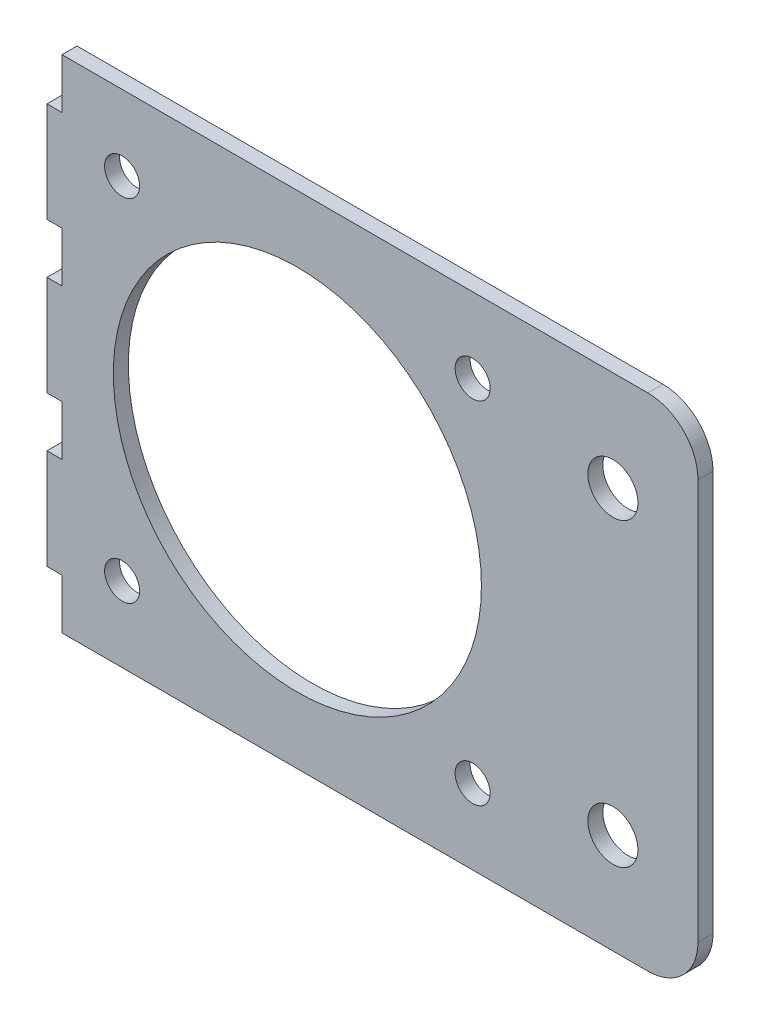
ISO-10303-21;
HEADER;
FILE_DESCRIPTION(('STEP AP214'),'2;1');
FILE_NAME('part.step','',(''),(''),'','','');
FILE_SCHEMA(('AUTOMOTIVE_DESIGN { 1 0 10303 214 1 1 1 1 }'));
ENDSEC;
DATA;
#1=APPLICATION_CONTEXT('core data for automotive mechanical design processes');
#2=APPLICATION_PROTOCOL_DEFINITION('international standard','automotive_design',2000,#1);
#3=PRODUCT_CONTEXT('',#1,'mechanical');
#4=PRODUCT('Part','Part','',(#3));
#5=PRODUCT_RELATED_PRODUCT_CATEGORY('part','',(#4));
#6=PRODUCT_DEFINITION_FORMATION('','',#4);
#7=PRODUCT_DEFINITION_CONTEXT('part definition',#1,'design');
#8=PRODUCT_DEFINITION('design','',#6,#7);
#9=PRODUCT_DEFINITION_SHAPE('','',#8);
#10=(LENGTH_UNIT() NAMED_UNIT(*) SI_UNIT(.MILLI.,.METRE.));
#11=(NAMED_UNIT(*) PLANE_ANGLE_UNIT() SI_UNIT($,.RADIAN.));
#12=(NAMED_UNIT(*) SI_UNIT($,.STERADIAN.) SOLID_ANGLE_UNIT());
#13=UNCERTAINTY_MEASURE_WITH_UNIT(LENGTH_MEASURE(1.E-05),#10,'distance_accuracy_value','');
#14=(GEOMETRIC_REPRESENTATION_CONTEXT(3) GLOBAL_UNCERTAINTY_ASSIGNED_CONTEXT((#13)) GLOBAL_UNIT_ASSIGNED_CONTEXT((#10,
#11,#12)) REPRESENTATION_CONTEXT('',''));
#15=CARTESIAN_POINT('',(0.,0.,0.));
#16=DIRECTION('',(0.,0.,1.));
#17=DIRECTION('',(1.,0.,0.));
#18=AXIS2_PLACEMENT_3D('',#15,#16,#17);
#19=CARTESIAN_POINT('',(0.,0.,3.));
#20=DIRECTION('',(1.,0.,0.));
#21=DIRECTION('',(0.,0.,-1.));
#22=AXIS2_PLACEMENT_3D('',#19,#20,#21);
#23=PLANE('',#22);
#24=DIRECTION('',(0.,-1.,0.));
#25=VECTOR('',#24,1.);
#26=CARTESIAN_POINT('',(0.,0.,0.));
#27=LINE('',#26,#25);
#28=CARTESIAN_POINT('',(0.,60.,0.));
#29=VERTEX_POINT('',#28);
#30=CARTESIAN_POINT('',(0.,40.,0.));
#31=VERTEX_POINT('',#30);
#32=EDGE_CURVE('E188',#29,#31,#27,.T.);
#33=ORIENTED_EDGE('',*,*,#32,.T.);
#34=DIRECTION('',(0.,0.,1.));
#35=VECTOR('',#34,1.);
#36=CARTESIAN_POINT('',(0.,40.,-0.00100000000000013));
#37=LINE('',#36,#35);
#38=CARTESIAN_POINT('',(0.,40.,3.));
#39=VERTEX_POINT('',#38);
#40=EDGE_CURVE('E307',#31,#39,#37,.T.);
#41=ORIENTED_EDGE('',*,*,#40,.T.);
#42=DIRECTION('',(0.,-1.,0.));
#43=VECTOR('',#42,1.);
#44=CARTESIAN_POINT('',(0.,0.,3.));
#45=LINE('',#44,#43);
#46=CARTESIAN_POINT('',(0.,60.,3.));
#47=VERTEX_POINT('',#46);
#48=EDGE_CURVE('E268',#47,#39,#45,.T.);
#49=ORIENTED_EDGE('',*,*,#48,.F.);
#50=DIRECTION('',(0.,0.,1.));
#51=VECTOR('',#50,1.);
#52=CARTESIAN_POINT('',(0.,60.,-0.00100000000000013));
#53=LINE('',#52,#51);
#54=EDGE_CURVE('E287',#29,#47,#53,.T.);
#55=ORIENTED_EDGE('',*,*,#54,.F.);
#56=EDGE_LOOP('',(#33,#41,#49,#55));
#57=FACE_BOUND('',#56,.T.);
#58=ADVANCED_FACE('F33',(#57),#23,.F.);
#59=CARTESIAN_POINT('',(0.,90.,0.));
#60=VERTEX_POINT('',#59);
#61=CARTESIAN_POINT('',(0.,70.,0.));
#62=VERTEX_POINT('',#61);
#63=EDGE_CURVE('E191',#60,#62,#27,.T.);
#64=ORIENTED_EDGE('',*,*,#63,.T.);
#65=DIRECTION('',(0.,0.,1.));
#66=VECTOR('',#65,1.);
#67=CARTESIAN_POINT('',(0.,70.,-0.00100000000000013));
#68=LINE('',#67,#66);
#69=CARTESIAN_POINT('',(0.,70.,3.));
#70=VERTEX_POINT('',#69);
#71=EDGE_CURVE('E254',#62,#70,#68,.T.);
#72=ORIENTED_EDGE('',*,*,#71,.T.);
#73=CARTESIAN_POINT('',(0.,90.,3.));
#74=VERTEX_POINT('',#73);
#75=EDGE_CURVE('E265',#74,#70,#45,.T.);
#76=ORIENTED_EDGE('',*,*,#75,.F.);
#77=DIRECTION('',(0.,0.,1.));
#78=VECTOR('',#77,1.);
#79=CARTESIAN_POINT('',(0.,90.,-0.00100000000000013));
#80=LINE('',#79,#78);
#81=EDGE_CURVE('E260',#60,#74,#80,.T.);
#82=ORIENTED_EDGE('',*,*,#81,.F.);
#83=EDGE_LOOP('',(#64,#72,#76,#82));
#84=FACE_BOUND('',#83,.T.);
#85=ADVANCED_FACE('F276',(#84),#23,.F.);
#86=CARTESIAN_POINT('',(0.,30.,0.));
#87=VERTEX_POINT('',#86);
#88=CARTESIAN_POINT('',(0.,10.,0.));
#89=VERTEX_POINT('',#88);
#90=EDGE_CURVE('E180',#87,#89,#27,.T.);
#91=ORIENTED_EDGE('',*,*,#90,.T.);
#92=DIRECTION('',(0.,0.,1.));
#93=VECTOR('',#92,1.);
#94=CARTESIAN_POINT('',(0.,10.,-0.00100000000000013));
#95=LINE('',#94,#93);
#96=CARTESIAN_POINT('',(0.,10.,3.));
#97=VERTEX_POINT('',#96);
#98=EDGE_CURVE('E161',#89,#97,#95,.T.);
#99=ORIENTED_EDGE('',*,*,#98,.T.);
#100=CARTESIAN_POINT('',(0.,30.,3.));
#101=VERTEX_POINT('',#100);
#102=EDGE_CURVE('E211',#101,#97,#45,.T.);
#103=ORIENTED_EDGE('',*,*,#102,.F.);
#104=DIRECTION('',(0.,0.,1.));
#105=VECTOR('',#104,1.);
#106=CARTESIAN_POINT('',(0.,30.,-0.00100000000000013));
#107=LINE('',#106,#105);
#108=EDGE_CURVE('E187',#87,#101,#107,.T.);
#109=ORIENTED_EDGE('',*,*,#108,.F.);
#110=EDGE_LOOP('',(#91,#99,#103,#109));
#111=FACE_BOUND('',#110,.T.);
#112=ADVANCED_FACE('F186',(#111),#23,.F.);
#113=CARTESIAN_POINT('',(0.,0.,3.));
#114=DIRECTION('',(0.,1.,0.));
#115=DIRECTION('',(0.,0.,1.));
#116=AXIS2_PLACEMENT_3D('',#113,#114,#115);
#117=PLANE('',#116);
#118=DIRECTION('',(1.,0.,0.));
#119=VECTOR('',#118,1.);
#120=CARTESIAN_POINT('',(0.,0.,0.));
#121=LINE('',#120,#119);
#122=CARTESIAN_POINT('',(3.,0.,0.));
#123=VERTEX_POINT('',#122);
#124=CARTESIAN_POINT('',(120.,0.,0.));
#125=VERTEX_POINT('',#124);
#126=EDGE_CURVE('E199',#123,#125,#121,.T.);
#127=ORIENTED_EDGE('',*,*,#126,.T.);
#128=DIRECTION('',(0.,0.,-1.));
#129=VECTOR('',#128,1.);
#130=CARTESIAN_POINT('',(120.,0.,3.));
#131=LINE('',#130,#129);
#132=CARTESIAN_POINT('',(120.,0.,3.));
#133=VERTEX_POINT('',#132);
#134=EDGE_CURVE('E56',#125,#133,#131,.F.);
#135=ORIENTED_EDGE('',*,*,#134,.T.);
#136=DIRECTION('',(1.,0.,0.));
#137=VECTOR('',#136,1.);
#138=CARTESIAN_POINT('',(0.,0.,3.));
#139=LINE('',#138,#137);
#140=CARTESIAN_POINT('',(3.,0.,3.));
#141=VERTEX_POINT('',#140);
#142=EDGE_CURVE('E228',#141,#133,#139,.T.);
#143=ORIENTED_EDGE('',*,*,#142,.F.);
#144=DIRECTION('',(0.,0.,1.));
#145=VECTOR('',#144,1.);
#146=CARTESIAN_POINT('',(3.,0.,-0.00100000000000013));
#147=LINE('',#146,#145);
#148=EDGE_CURVE('E328',#123,#141,#147,.T.);
#149=ORIENTED_EDGE('',*,*,#148,.F.);
#150=EDGE_LOOP('',(#127,#135,#143,#149));
#151=FACE_BOUND('',#150,.T.);
#152=ADVANCED_FACE('F427',(#151),#117,.F.);
#153=CARTESIAN_POINT('',(130.,0.,3.));
#154=DIRECTION('',(-1.,0.,0.));
#155=DIRECTION('',(0.,0.,1.));
#156=AXIS2_PLACEMENT_3D('',#153,#154,#155);
#157=PLANE('',#156);
#158=DIRECTION('',(0.,1.,0.));
#159=VECTOR('',#158,1.);
#160=CARTESIAN_POINT('',(130.,0.,3.));
#161=LINE('',#160,#159);
#162=CARTESIAN_POINT('',(130.,10.,3.));
#163=VERTEX_POINT('',#162);
#164=CARTESIAN_POINT('',(130.,90.,3.));
#165=VERTEX_POINT('',#164);
#166=EDGE_CURVE('E226',#163,#165,#161,.T.);
#167=ORIENTED_EDGE('',*,*,#166,.F.);
#168=DIRECTION('',(0.,0.,-1.));
#169=VECTOR('',#168,1.);
#170=CARTESIAN_POINT('',(130.,10.,3.));
#171=LINE('',#170,#169);
#172=CARTESIAN_POINT('',(130.,10.,0.));
#173=VERTEX_POINT('',#172);
#174=EDGE_CURVE('E214',#163,#173,#171,.T.);
#175=ORIENTED_EDGE('',*,*,#174,.T.);
#176=DIRECTION('',(0.,1.,0.));
#177=VECTOR('',#176,1.);
#178=CARTESIAN_POINT('',(130.,0.,0.));
#179=LINE('',#178,#177);
#180=CARTESIAN_POINT('',(130.,90.,0.));
#181=VERTEX_POINT('',#180);
#182=EDGE_CURVE('E204',#173,#181,#179,.T.);
#183=ORIENTED_EDGE('',*,*,#182,.T.);
#184=DIRECTION('',(0.,0.,-1.));
#185=VECTOR('',#184,1.);
#186=CARTESIAN_POINT('',(130.,90.,3.));
#187=LINE('',#186,#185);
#188=EDGE_CURVE('E212',#181,#165,#187,.F.);
#189=ORIENTED_EDGE('',*,*,#188,.T.);
#190=EDGE_LOOP('',(#167,#175,#183,#189));
#191=FACE_BOUND('',#190,.T.);
#192=ADVANCED_FACE('F232',(#191),#157,.F.);
#193=CARTESIAN_POINT('',(0.,100.,3.));
#194=DIRECTION('',(0.,-1.,0.));
#195=DIRECTION('',(0.,0.,-1.));
#196=AXIS2_PLACEMENT_3D('',#193,#194,#195);
#197=PLANE('',#196);
#198=DIRECTION('',(-1.,0.,0.));
#199=VECTOR('',#198,1.);
#200=CARTESIAN_POINT('',(0.,100.,3.));
#201=LINE('',#200,#199);
#202=CARTESIAN_POINT('',(120.,100.,3.));
#203=VERTEX_POINT('',#202);
#204=CARTESIAN_POINT('',(3.,100.,3.));
#205=VERTEX_POINT('',#204);
#206=EDGE_CURVE('E215',#203,#205,#201,.T.);
#207=ORIENTED_EDGE('',*,*,#206,.F.);
#208=DIRECTION('',(0.,0.,-1.));
#209=VECTOR('',#208,1.);
#210=CARTESIAN_POINT('',(120.,100.,3.));
#211=LINE('',#210,#209);
#212=CARTESIAN_POINT('',(120.,100.,0.));
#213=VERTEX_POINT('',#212);
#214=EDGE_CURVE('E11',#203,#213,#211,.T.);
#215=ORIENTED_EDGE('',*,*,#214,.T.);
#216=DIRECTION('',(-1.,0.,0.));
#217=VECTOR('',#216,1.);
#218=CARTESIAN_POINT('',(0.,100.,0.));
#219=LINE('',#218,#217);
#220=CARTESIAN_POINT('',(3.,100.,0.));
#221=VERTEX_POINT('',#220);
#222=EDGE_CURVE('E207',#213,#221,#219,.T.);
#223=ORIENTED_EDGE('',*,*,#222,.T.);
#224=DIRECTION('',(0.,0.,1.));
#225=VECTOR('',#224,1.);
#226=CARTESIAN_POINT('',(3.,100.,-0.00100000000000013));
#227=LINE('',#226,#225);
#228=EDGE_CURVE('E194',#221,#205,#227,.T.);
#229=ORIENTED_EDGE('',*,*,#228,.T.);
#230=EDGE_LOOP('',(#207,#215,#223,#229));
#231=FACE_BOUND('',#230,.T.);
#232=ADVANCED_FACE('F240',(#231),#197,.F.);
#233=CARTESIAN_POINT('',(0.,0.,3.));
#234=DIRECTION('',(0.,0.,-1.));
#235=DIRECTION('',(-1.,0.,0.));
#236=AXIS2_PLACEMENT_3D('',#233,#234,#235);
#237=PLANE('',#236);
#238=CARTESIAN_POINT('',(113.,20.,3.));
#239=DIRECTION('',(0.,0.,1.));
#240=DIRECTION('',(1.,0.,0.));
#241=AXIS2_PLACEMENT_3D('',#238,#239,#240);
#242=CIRCLE('',#241,5.);
#243=CARTESIAN_POINT('',(118.,20.,3.));
#244=VERTEX_POINT('',#243);
#245=EDGE_CURVE('E372',#244,#244,#242,.T.);
#246=ORIENTED_EDGE('',*,*,#245,.F.);
#247=EDGE_LOOP('',(#246));
#248=FACE_BOUND('',#247,.T.);
#249=CARTESIAN_POINT('',(85.,15.,3.));
#250=DIRECTION('',(0.,0.,1.));
#251=DIRECTION('',(1.,0.,0.));
#252=AXIS2_PLACEMENT_3D('',#249,#250,#251);
#253=CIRCLE('',#252,3.50000000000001);
#254=CARTESIAN_POINT('',(88.5,15.,3.));
#255=VERTEX_POINT('',#254);
#256=EDGE_CURVE('E366',#255,#255,#253,.T.);
#257=ORIENTED_EDGE('',*,*,#256,.F.);
#258=EDGE_LOOP('',(#257));
#259=FACE_BOUND('',#258,.T.);
#260=CARTESIAN_POINT('',(15.,15.,3.));
#261=DIRECTION('',(0.,0.,1.));
#262=DIRECTION('',(1.,0.,0.));
#263=AXIS2_PLACEMENT_3D('',#260,#261,#262);
#264=CIRCLE('',#263,3.5);
#265=CARTESIAN_POINT('',(18.5,15.,3.));
#266=VERTEX_POINT('',#265);
#267=EDGE_CURVE('E360',#266,#266,#264,.T.);
#268=ORIENTED_EDGE('',*,*,#267,.F.);
#269=EDGE_LOOP('',(#268));
#270=FACE_BOUND('',#269,.T.);
#271=CARTESIAN_POINT('',(85.,85.,3.));
#272=DIRECTION('',(0.,0.,1.));
#273=DIRECTION('',(1.,0.,0.));
#274=AXIS2_PLACEMENT_3D('',#271,#272,#273);
#275=CIRCLE('',#274,3.50000000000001);
#276=CARTESIAN_POINT('',(88.5,85.,3.));
#277=VERTEX_POINT('',#276);
#278=EDGE_CURVE('E354',#277,#277,#275,.T.);
#279=ORIENTED_EDGE('',*,*,#278,.F.);
#280=EDGE_LOOP('',(#279));
#281=FACE_BOUND('',#280,.T.);
#282=CARTESIAN_POINT('',(15.,85.,3.));
#283=DIRECTION('',(0.,0.,1.));
#284=DIRECTION('',(1.,0.,0.));
#285=AXIS2_PLACEMENT_3D('',#282,#283,#284);
#286=CIRCLE('',#285,3.50000000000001);
#287=CARTESIAN_POINT('',(18.5,85.,3.));
#288=VERTEX_POINT('',#287);
#289=EDGE_CURVE('E348',#288,#288,#286,.T.);
#290=ORIENTED_EDGE('',*,*,#289,.F.);
#291=EDGE_LOOP('',(#290));
#292=FACE_BOUND('',#291,.T.);
#293=CARTESIAN_POINT('',(113.,80.,3.));
#294=DIRECTION('',(0.,0.,1.));
#295=DIRECTION('',(1.,0.,0.));
#296=AXIS2_PLACEMENT_3D('',#293,#294,#295);
#297=CIRCLE('',#296,5.00000000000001);
#298=CARTESIAN_POINT('',(118.,80.,3.));
#299=VERTEX_POINT('',#298);
#300=EDGE_CURVE('E342',#299,#299,#297,.T.);
#301=ORIENTED_EDGE('',*,*,#300,.F.);
#302=EDGE_LOOP('',(#301));
#303=FACE_BOUND('',#302,.T.);
#304=CARTESIAN_POINT('',(50.,50.,3.));
#305=DIRECTION('',(0.,0.,1.));
#306=DIRECTION('',(1.,0.,0.));
#307=AXIS2_PLACEMENT_3D('',#304,#305,#306);
#308=CIRCLE('',#307,36.75);
#309=CARTESIAN_POINT('',(86.75,50.,3.));
#310=VERTEX_POINT('',#309);
#311=EDGE_CURVE('E336',#310,#310,#308,.T.);
#312=ORIENTED_EDGE('',*,*,#311,.F.);
#313=EDGE_LOOP('',(#312));
#314=FACE_BOUND('',#313,.T.);
#315=ORIENTED_EDGE('',*,*,#142,.T.);
#316=CARTESIAN_POINT('',(120.,10.,3.));
#317=DIRECTION('',(0.,0.,-1.));
#318=DIRECTION('',(-1.,0.,0.));
#319=AXIS2_PLACEMENT_3D('',#316,#317,#318);
#320=CIRCLE('',#319,10.);
#321=EDGE_CURVE('E41',#133,#163,#320,.F.);
#322=ORIENTED_EDGE('',*,*,#321,.T.);
#323=ORIENTED_EDGE('',*,*,#166,.T.);
#324=CARTESIAN_POINT('',(120.,90.,3.));
#325=DIRECTION('',(0.,0.,-1.));
#326=DIRECTION('',(-1.,0.,0.));
#327=AXIS2_PLACEMENT_3D('',#324,#325,#326);
#328=CIRCLE('',#327,10.);
#329=EDGE_CURVE('E48',#165,#203,#328,.F.);
#330=ORIENTED_EDGE('',*,*,#329,.T.);
#331=ORIENTED_EDGE('',*,*,#206,.T.);
#332=DIRECTION('',(0.,1.,0.));
#333=VECTOR('',#332,1.);
#334=CARTESIAN_POINT('',(3.,100.,3.));
#335=LINE('',#334,#333);
#336=CARTESIAN_POINT('',(3.,90.,3.));
#337=VERTEX_POINT('',#336);
#338=EDGE_CURVE('E251',#337,#205,#335,.T.);
#339=ORIENTED_EDGE('',*,*,#338,.F.);
#340=DIRECTION('',(1.,0.,0.));
#341=VECTOR('',#340,1.);
#342=CARTESIAN_POINT('',(0.,90.,3.));
#343=LINE('',#342,#341);
#344=EDGE_CURVE('E247',#74,#337,#343,.T.);
#345=ORIENTED_EDGE('',*,*,#344,.F.);
#346=ORIENTED_EDGE('',*,*,#75,.T.);
#347=DIRECTION('',(-1.,0.,0.));
#348=VECTOR('',#347,1.);
#349=CARTESIAN_POINT('',(0.,70.,3.));
#350=LINE('',#349,#348);
#351=CARTESIAN_POINT('',(3.,70.,3.));
#352=VERTEX_POINT('',#351);
#353=EDGE_CURVE('E284',#352,#70,#350,.T.);
#354=ORIENTED_EDGE('',*,*,#353,.F.);
#355=DIRECTION('',(0.,1.,0.));
#356=VECTOR('',#355,1.);
#357=CARTESIAN_POINT('',(3.,70.,3.));
#358=LINE('',#357,#356);
#359=CARTESIAN_POINT('',(3.,60.,3.));
#360=VERTEX_POINT('',#359);
#361=EDGE_CURVE('E292',#360,#352,#358,.T.);
#362=ORIENTED_EDGE('',*,*,#361,.F.);
#363=DIRECTION('',(1.,0.,0.));
#364=VECTOR('',#363,1.);
#365=CARTESIAN_POINT('',(0.,60.,3.));
#366=LINE('',#365,#364);
#367=EDGE_CURVE('E294',#47,#360,#366,.T.);
#368=ORIENTED_EDGE('',*,*,#367,.F.);
#369=ORIENTED_EDGE('',*,*,#48,.T.);
#370=DIRECTION('',(-1.,0.,0.));
#371=VECTOR('',#370,1.);
#372=CARTESIAN_POINT('',(0.,40.,3.));
#373=LINE('',#372,#371);
#374=CARTESIAN_POINT('',(3.,40.,3.));
#375=VERTEX_POINT('',#374);
#376=EDGE_CURVE('E310',#375,#39,#373,.T.);
#377=ORIENTED_EDGE('',*,*,#376,.F.);
#378=DIRECTION('',(0.,1.,0.));
#379=VECTOR('',#378,1.);
#380=CARTESIAN_POINT('',(3.,40.,3.));
#381=LINE('',#380,#379);
#382=CARTESIAN_POINT('',(3.,30.,3.));
#383=VERTEX_POINT('',#382);
#384=EDGE_CURVE('E317',#383,#375,#381,.T.);
#385=ORIENTED_EDGE('',*,*,#384,.F.);
#386=DIRECTION('',(1.,0.,0.));
#387=VECTOR('',#386,1.);
#388=CARTESIAN_POINT('',(0.,30.,3.));
#389=LINE('',#388,#387);
#390=EDGE_CURVE('E320',#101,#383,#389,.T.);
#391=ORIENTED_EDGE('',*,*,#390,.F.);
#392=ORIENTED_EDGE('',*,*,#102,.T.);
#393=DIRECTION('',(-1.,0.,0.));
#394=VECTOR('',#393,1.);
#395=CARTESIAN_POINT('',(0.,10.,3.));
#396=LINE('',#395,#394);
#397=CARTESIAN_POINT('',(3.,10.,3.));
#398=VERTEX_POINT('',#397);
#399=EDGE_CURVE('E167',#398,#97,#396,.T.);
#400=ORIENTED_EDGE('',*,*,#399,.F.);
#401=DIRECTION('',(0.,1.,0.));
#402=VECTOR('',#401,1.);
#403=CARTESIAN_POINT('',(3.,0.,3.));
#404=LINE('',#403,#402);
#405=EDGE_CURVE('E183',#141,#398,#404,.T.);
#406=ORIENTED_EDGE('',*,*,#405,.F.);
#407=EDGE_LOOP('',(#315,#322,#323,#330,#331,#339,#345,#346,#354,#362,#368,#369,#377,#385,#391,
#392,#400,#406));
#408=FACE_BOUND('',#407,.T.);
#409=ADVANCED_FACE('F225',(#248,#259,#270,#281,#292,#303,#314,#408),#237,.F.);
#410=CARTESIAN_POINT('',(0.,0.,0.));
#411=DIRECTION('',(0.,0.,-1.));
#412=DIRECTION('',(-1.,0.,0.));
#413=AXIS2_PLACEMENT_3D('',#410,#411,#412);
#414=PLANE('',#413);
#415=CARTESIAN_POINT('',(113.,20.,0.));
#416=DIRECTION('',(0.,0.,1.));
#417=DIRECTION('',(1.,0.,0.));
#418=AXIS2_PLACEMENT_3D('',#415,#416,#417);
#419=CIRCLE('',#418,5.);
#420=CARTESIAN_POINT('',(118.,20.,0.));
#421=VERTEX_POINT('',#420);
#422=EDGE_CURVE('E369',#421,#421,#419,.T.);
#423=ORIENTED_EDGE('',*,*,#422,.T.);
#424=EDGE_LOOP('',(#423));
#425=FACE_BOUND('',#424,.T.);
#426=CARTESIAN_POINT('',(85.,15.,0.));
#427=DIRECTION('',(0.,0.,1.));
#428=DIRECTION('',(1.,0.,0.));
#429=AXIS2_PLACEMENT_3D('',#426,#427,#428);
#430=CIRCLE('',#429,3.50000000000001);
#431=CARTESIAN_POINT('',(88.5,15.,0.));
#432=VERTEX_POINT('',#431);
#433=EDGE_CURVE('E363',#432,#432,#430,.T.);
#434=ORIENTED_EDGE('',*,*,#433,.T.);
#435=EDGE_LOOP('',(#434));
#436=FACE_BOUND('',#435,.T.);
#437=CARTESIAN_POINT('',(15.,15.,0.));
#438=DIRECTION('',(0.,0.,1.));
#439=DIRECTION('',(1.,0.,0.));
#440=AXIS2_PLACEMENT_3D('',#437,#438,#439);
#441=CIRCLE('',#440,3.5);
#442=CARTESIAN_POINT('',(18.5,15.,0.));
#443=VERTEX_POINT('',#442);
#444=EDGE_CURVE('E357',#443,#443,#441,.T.);
#445=ORIENTED_EDGE('',*,*,#444,.T.);
#446=EDGE_LOOP('',(#445));
#447=FACE_BOUND('',#446,.T.);
#448=CARTESIAN_POINT('',(85.,85.,0.));
#449=DIRECTION('',(0.,0.,1.));
#450=DIRECTION('',(1.,0.,0.));
#451=AXIS2_PLACEMENT_3D('',#448,#449,#450);
#452=CIRCLE('',#451,3.50000000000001);
#453=CARTESIAN_POINT('',(88.5,85.,0.));
#454=VERTEX_POINT('',#453);
#455=EDGE_CURVE('E351',#454,#454,#452,.T.);
#456=ORIENTED_EDGE('',*,*,#455,.T.);
#457=EDGE_LOOP('',(#456));
#458=FACE_BOUND('',#457,.T.);
#459=CARTESIAN_POINT('',(15.,85.,0.));
#460=DIRECTION('',(0.,0.,1.));
#461=DIRECTION('',(1.,0.,0.));
#462=AXIS2_PLACEMENT_3D('',#459,#460,#461);
#463=CIRCLE('',#462,3.50000000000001);
#464=CARTESIAN_POINT('',(18.5,85.,0.));
#465=VERTEX_POINT('',#464);
#466=EDGE_CURVE('E345',#465,#465,#463,.T.);
#467=ORIENTED_EDGE('',*,*,#466,.T.);
#468=EDGE_LOOP('',(#467));
#469=FACE_BOUND('',#468,.T.);
#470=CARTESIAN_POINT('',(113.,80.,0.));
#471=DIRECTION('',(0.,0.,1.));
#472=DIRECTION('',(1.,0.,0.));
#473=AXIS2_PLACEMENT_3D('',#470,#471,#472);
#474=CIRCLE('',#473,5.00000000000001);
#475=CARTESIAN_POINT('',(118.,80.,0.));
#476=VERTEX_POINT('',#475);
#477=EDGE_CURVE('E339',#476,#476,#474,.T.);
#478=ORIENTED_EDGE('',*,*,#477,.T.);
#479=EDGE_LOOP('',(#478));
#480=FACE_BOUND('',#479,.T.);
#481=CARTESIAN_POINT('',(50.,50.,0.));
#482=DIRECTION('',(0.,0.,1.));
#483=DIRECTION('',(1.,0.,0.));
#484=AXIS2_PLACEMENT_3D('',#481,#482,#483);
#485=CIRCLE('',#484,36.75);
#486=CARTESIAN_POINT('',(86.75,50.,0.));
#487=VERTEX_POINT('',#486);
#488=EDGE_CURVE('E335',#487,#487,#485,.T.);
#489=ORIENTED_EDGE('',*,*,#488,.T.);
#490=EDGE_LOOP('',(#489));
#491=FACE_BOUND('',#490,.T.);
#492=ORIENTED_EDGE('',*,*,#182,.F.);
#493=CARTESIAN_POINT('',(120.,10.,0.));
#494=DIRECTION('',(0.,0.,-1.));
#495=DIRECTION('',(-1.,0.,0.));
#496=AXIS2_PLACEMENT_3D('',#493,#494,#495);
#497=CIRCLE('',#496,10.);
#498=EDGE_CURVE('E220',#173,#125,#497,.T.);
#499=ORIENTED_EDGE('',*,*,#498,.T.);
#500=ORIENTED_EDGE('',*,*,#126,.F.);
#501=DIRECTION('',(0.,1.,0.));
#502=VECTOR('',#501,1.);
#503=CARTESIAN_POINT('',(3.,0.,0.));
#504=LINE('',#503,#502);
#505=CARTESIAN_POINT('',(3.,10.,0.));
#506=VERTEX_POINT('',#505);
#507=EDGE_CURVE('E182',#123,#506,#504,.T.);
#508=ORIENTED_EDGE('',*,*,#507,.T.);
#509=DIRECTION('',(-1.,0.,0.));
#510=VECTOR('',#509,1.);
#511=CARTESIAN_POINT('',(0.,10.,0.));
#512=LINE('',#511,#510);
#513=EDGE_CURVE('E164',#506,#89,#512,.T.);
#514=ORIENTED_EDGE('',*,*,#513,.T.);
#515=ORIENTED_EDGE('',*,*,#90,.F.);
#516=DIRECTION('',(1.,0.,0.));
#517=VECTOR('',#516,1.);
#518=CARTESIAN_POINT('',(0.,30.,0.));
#519=LINE('',#518,#517);
#520=CARTESIAN_POINT('',(3.,30.,0.));
#521=VERTEX_POINT('',#520);
#522=EDGE_CURVE('E305',#87,#521,#519,.T.);
#523=ORIENTED_EDGE('',*,*,#522,.T.);
#524=DIRECTION('',(0.,1.,0.));
#525=VECTOR('',#524,1.);
#526=CARTESIAN_POINT('',(3.,40.,0.));
#527=LINE('',#526,#525);
#528=CARTESIAN_POINT('',(3.,40.,0.));
#529=VERTEX_POINT('',#528);
#530=EDGE_CURVE('E172',#521,#529,#527,.T.);
#531=ORIENTED_EDGE('',*,*,#530,.T.);
#532=DIRECTION('',(-1.,0.,0.));
#533=VECTOR('',#532,1.);
#534=CARTESIAN_POINT('',(0.,40.,0.));
#535=LINE('',#534,#533);
#536=EDGE_CURVE('E323',#529,#31,#535,.T.);
#537=ORIENTED_EDGE('',*,*,#536,.T.);
#538=ORIENTED_EDGE('',*,*,#32,.F.);
#539=DIRECTION('',(1.,0.,0.));
#540=VECTOR('',#539,1.);
#541=CARTESIAN_POINT('',(0.,60.,0.));
#542=LINE('',#541,#540);
#543=CARTESIAN_POINT('',(3.,60.,0.));
#544=VERTEX_POINT('',#543);
#545=EDGE_CURVE('E248',#29,#544,#542,.T.);
#546=ORIENTED_EDGE('',*,*,#545,.T.);
#547=DIRECTION('',(0.,1.,0.));
#548=VECTOR('',#547,1.);
#549=CARTESIAN_POINT('',(3.,70.,0.));
#550=LINE('',#549,#548);
#551=CARTESIAN_POINT('',(3.,70.,0.));
#552=VERTEX_POINT('',#551);
#553=EDGE_CURVE('E302',#544,#552,#550,.T.);
#554=ORIENTED_EDGE('',*,*,#553,.T.);
#555=DIRECTION('',(-1.,0.,0.));
#556=VECTOR('',#555,1.);
#557=CARTESIAN_POINT('',(0.,70.,0.));
#558=LINE('',#557,#556);
#559=EDGE_CURVE('E298',#552,#62,#558,.T.);
#560=ORIENTED_EDGE('',*,*,#559,.T.);
#561=ORIENTED_EDGE('',*,*,#63,.F.);
#562=DIRECTION('',(1.,0.,0.));
#563=VECTOR('',#562,1.);
#564=CARTESIAN_POINT('',(0.,90.,0.));
#565=LINE('',#564,#563);
#566=CARTESIAN_POINT('',(3.,90.,0.));
#567=VERTEX_POINT('',#566);
#568=EDGE_CURVE('E189',#60,#567,#565,.T.);
#569=ORIENTED_EDGE('',*,*,#568,.T.);
#570=DIRECTION('',(0.,1.,0.));
#571=VECTOR('',#570,1.);
#572=CARTESIAN_POINT('',(3.,100.,0.));
#573=LINE('',#572,#571);
#574=EDGE_CURVE('E245',#567,#221,#573,.T.);
#575=ORIENTED_EDGE('',*,*,#574,.T.);
#576=ORIENTED_EDGE('',*,*,#222,.F.);
#577=CARTESIAN_POINT('',(120.,90.,0.));
#578=DIRECTION('',(0.,0.,-1.));
#579=DIRECTION('',(-1.,0.,0.));
#580=AXIS2_PLACEMENT_3D('',#577,#578,#579);
#581=CIRCLE('',#580,10.);
#582=EDGE_CURVE('E218',#213,#181,#581,.T.);
#583=ORIENTED_EDGE('',*,*,#582,.T.);
#584=EDGE_LOOP('',(#492,#499,#500,#508,#514,#515,#523,#531,#537,#538,#546,#554,#560,#561,#569,
#575,#576,#583));
#585=FACE_BOUND('',#584,.T.);
#586=ADVANCED_FACE('F178',(#425,#436,#447,#458,#469,#480,#491,#585),#414,.T.);
#587=CARTESIAN_POINT('',(3.,100.,-0.00100000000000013));
#588=DIRECTION('',(1.,0.,0.));
#589=DIRECTION('',(0.,1.,0.));
#590=AXIS2_PLACEMENT_3D('',#587,#588,#589);
#591=PLANE('',#590);
#592=DIRECTION('',(0.,0.,1.));
#593=VECTOR('',#592,1.);
#594=CARTESIAN_POINT('',(3.,90.,-0.00100000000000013));
#595=LINE('',#594,#593);
#596=EDGE_CURVE('E262',#567,#337,#595,.T.);
#597=ORIENTED_EDGE('',*,*,#596,.T.);
#598=ORIENTED_EDGE('',*,*,#338,.T.);
#599=ORIENTED_EDGE('',*,*,#228,.F.);
#600=ORIENTED_EDGE('',*,*,#574,.F.);
#601=EDGE_LOOP('',(#597,#598,#599,#600));
#602=FACE_BOUND('',#601,.T.);
#603=ADVANCED_FACE('F271',(#602),#591,.F.);
#604=CARTESIAN_POINT('',(0.,90.,-0.00100000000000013));
#605=DIRECTION('',(0.,-1.,0.));
#606=DIRECTION('',(0.,0.,-1.));
#607=AXIS2_PLACEMENT_3D('',#604,#605,#606);
#608=PLANE('',#607);
#609=ORIENTED_EDGE('',*,*,#81,.T.);
#610=ORIENTED_EDGE('',*,*,#344,.T.);
#611=ORIENTED_EDGE('',*,*,#596,.F.);
#612=ORIENTED_EDGE('',*,*,#568,.F.);
#613=EDGE_LOOP('',(#609,#610,#611,#612));
#614=FACE_BOUND('',#613,.T.);
#615=ADVANCED_FACE('F273',(#614),#608,.F.);
#616=CARTESIAN_POINT('',(0.,70.,-0.00100000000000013));
#617=DIRECTION('',(0.,1.,0.));
#618=DIRECTION('',(0.,0.,1.));
#619=AXIS2_PLACEMENT_3D('',#616,#617,#618);
#620=PLANE('',#619);
#621=DIRECTION('',(0.,0.,1.));
#622=VECTOR('',#621,1.);
#623=CARTESIAN_POINT('',(3.,70.,-0.00100000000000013));
#624=LINE('',#623,#622);
#625=EDGE_CURVE('E279',#552,#352,#624,.T.);
#626=ORIENTED_EDGE('',*,*,#625,.T.);
#627=ORIENTED_EDGE('',*,*,#353,.T.);
#628=ORIENTED_EDGE('',*,*,#71,.F.);
#629=ORIENTED_EDGE('',*,*,#559,.F.);
#630=EDGE_LOOP('',(#626,#627,#628,#629));
#631=FACE_BOUND('',#630,.T.);
#632=ADVANCED_FACE('F443',(#631),#620,.F.);
#633=CARTESIAN_POINT('',(3.,70.,-0.00100000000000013));
#634=DIRECTION('',(1.,0.,0.));
#635=DIRECTION('',(0.,1.,0.));
#636=AXIS2_PLACEMENT_3D('',#633,#634,#635);
#637=PLANE('',#636);
#638=DIRECTION('',(0.,0.,1.));
#639=VECTOR('',#638,1.);
#640=CARTESIAN_POINT('',(3.,60.,-0.00100000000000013));
#641=LINE('',#640,#639);
#642=EDGE_CURVE('E281',#544,#360,#641,.T.);
#643=ORIENTED_EDGE('',*,*,#642,.T.);
#644=ORIENTED_EDGE('',*,*,#361,.T.);
#645=ORIENTED_EDGE('',*,*,#625,.F.);
#646=ORIENTED_EDGE('',*,*,#553,.F.);
#647=EDGE_LOOP('',(#643,#644,#645,#646));
#648=FACE_BOUND('',#647,.T.);
#649=ADVANCED_FACE('F450',(#648),#637,.F.);
#650=CARTESIAN_POINT('',(0.,60.,-0.00100000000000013));
#651=DIRECTION('',(0.,-1.,0.));
#652=DIRECTION('',(0.,0.,-1.));
#653=AXIS2_PLACEMENT_3D('',#650,#651,#652);
#654=PLANE('',#653);
#655=ORIENTED_EDGE('',*,*,#54,.T.);
#656=ORIENTED_EDGE('',*,*,#367,.T.);
#657=ORIENTED_EDGE('',*,*,#642,.F.);
#658=ORIENTED_EDGE('',*,*,#545,.F.);
#659=EDGE_LOOP('',(#655,#656,#657,#658));
#660=FACE_BOUND('',#659,.T.);
#661=ADVANCED_FACE('F446',(#660),#654,.F.);
#662=CARTESIAN_POINT('',(0.,40.,-0.00100000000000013));
#663=DIRECTION('',(0.,1.,0.));
#664=DIRECTION('',(0.,0.,1.));
#665=AXIS2_PLACEMENT_3D('',#662,#663,#664);
#666=PLANE('',#665);
#667=DIRECTION('',(0.,0.,1.));
#668=VECTOR('',#667,1.);
#669=CARTESIAN_POINT('',(3.,40.,-0.00100000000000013));
#670=LINE('',#669,#668);
#671=EDGE_CURVE('E312',#529,#375,#670,.T.);
#672=ORIENTED_EDGE('',*,*,#671,.T.);
#673=ORIENTED_EDGE('',*,*,#376,.T.);
#674=ORIENTED_EDGE('',*,*,#40,.F.);
#675=ORIENTED_EDGE('',*,*,#536,.F.);
#676=EDGE_LOOP('',(#672,#673,#674,#675));
#677=FACE_BOUND('',#676,.T.);
#678=ADVANCED_FACE('F449',(#677),#666,.F.);
#679=CARTESIAN_POINT('',(3.,40.,-0.00100000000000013));
#680=DIRECTION('',(1.,0.,0.));
#681=DIRECTION('',(0.,1.,0.));
#682=AXIS2_PLACEMENT_3D('',#679,#680,#681);
#683=PLANE('',#682);
#684=DIRECTION('',(0.,0.,1.));
#685=VECTOR('',#684,1.);
#686=CARTESIAN_POINT('',(3.,30.,-0.00100000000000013));
#687=LINE('',#686,#685);
#688=EDGE_CURVE('E309',#521,#383,#687,.T.);
#689=ORIENTED_EDGE('',*,*,#688,.T.);
#690=ORIENTED_EDGE('',*,*,#384,.T.);
#691=ORIENTED_EDGE('',*,*,#671,.F.);
#692=ORIENTED_EDGE('',*,*,#530,.F.);
#693=EDGE_LOOP('',(#689,#690,#691,#692));
#694=FACE_BOUND('',#693,.T.);
#695=ADVANCED_FACE('F458',(#694),#683,.F.);
#696=CARTESIAN_POINT('',(0.,30.,-0.00100000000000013));
#697=DIRECTION('',(0.,-1.,0.));
#698=DIRECTION('',(0.,0.,-1.));
#699=AXIS2_PLACEMENT_3D('',#696,#697,#698);
#700=PLANE('',#699);
#701=ORIENTED_EDGE('',*,*,#108,.T.);
#702=ORIENTED_EDGE('',*,*,#390,.T.);
#703=ORIENTED_EDGE('',*,*,#688,.F.);
#704=ORIENTED_EDGE('',*,*,#522,.F.);
#705=EDGE_LOOP('',(#701,#702,#703,#704));
#706=FACE_BOUND('',#705,.T.);
#707=ADVANCED_FACE('F455',(#706),#700,.F.);
#708=CARTESIAN_POINT('',(0.,10.,-0.00100000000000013));
#709=DIRECTION('',(0.,1.,0.));
#710=DIRECTION('',(0.,0.,1.));
#711=AXIS2_PLACEMENT_3D('',#708,#709,#710);
#712=PLANE('',#711);
#713=DIRECTION('',(0.,0.,1.));
#714=VECTOR('',#713,1.);
#715=CARTESIAN_POINT('',(3.,10.,-0.00100000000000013));
#716=LINE('',#715,#714);
#717=EDGE_CURVE('E173',#506,#398,#716,.T.);
#718=ORIENTED_EDGE('',*,*,#717,.T.);
#719=ORIENTED_EDGE('',*,*,#399,.T.);
#720=ORIENTED_EDGE('',*,*,#98,.F.);
#721=ORIENTED_EDGE('',*,*,#513,.F.);
#722=EDGE_LOOP('',(#718,#719,#720,#721));
#723=FACE_BOUND('',#722,.T.);
#724=ADVANCED_FACE('F163',(#723),#712,.F.);
#725=CARTESIAN_POINT('',(3.,0.,-0.00100000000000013));
#726=DIRECTION('',(1.,0.,0.));
#727=DIRECTION('',(0.,0.,-1.));
#728=AXIS2_PLACEMENT_3D('',#725,#726,#727);
#729=PLANE('',#728);
#730=ORIENTED_EDGE('',*,*,#148,.T.);
#731=ORIENTED_EDGE('',*,*,#405,.T.);
#732=ORIENTED_EDGE('',*,*,#717,.F.);
#733=ORIENTED_EDGE('',*,*,#507,.F.);
#734=EDGE_LOOP('',(#730,#731,#732,#733));
#735=FACE_BOUND('',#734,.T.);
#736=ADVANCED_FACE('F405',(#735),#729,.F.);
#737=CARTESIAN_POINT('',(50.,50.,0.));
#738=DIRECTION('',(0.,0.,1.));
#739=DIRECTION('',(1.,0.,0.));
#740=AXIS2_PLACEMENT_3D('',#737,#738,#739);
#741=CYLINDRICAL_SURFACE('',#740,36.75);
#742=ORIENTED_EDGE('',*,*,#488,.F.);
#743=EDGE_LOOP('',(#742));
#744=FACE_BOUND('',#743,.T.);
#745=ORIENTED_EDGE('',*,*,#311,.T.);
#746=EDGE_LOOP('',(#745));
#747=FACE_BOUND('',#746,.T.);
#748=ADVANCED_FACE('F402',(#744,#747),#741,.F.);
#749=CARTESIAN_POINT('',(113.,80.,0.));
#750=DIRECTION('',(0.,0.,1.));
#751=DIRECTION('',(1.,0.,0.));
#752=AXIS2_PLACEMENT_3D('',#749,#750,#751);
#753=CYLINDRICAL_SURFACE('',#752,5.00000000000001);
#754=ORIENTED_EDGE('',*,*,#477,.F.);
#755=EDGE_LOOP('',(#754));
#756=FACE_BOUND('',#755,.T.);
#757=ORIENTED_EDGE('',*,*,#300,.T.);
#758=EDGE_LOOP('',(#757));
#759=FACE_BOUND('',#758,.T.);
#760=ADVANCED_FACE('F404',(#756,#759),#753,.F.);
#761=CARTESIAN_POINT('',(15.,85.,0.));
#762=DIRECTION('',(0.,0.,1.));
#763=DIRECTION('',(1.,0.,0.));
#764=AXIS2_PLACEMENT_3D('',#761,#762,#763);
#765=CYLINDRICAL_SURFACE('',#764,3.50000000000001);
#766=ORIENTED_EDGE('',*,*,#466,.F.);
#767=EDGE_LOOP('',(#766));
#768=FACE_BOUND('',#767,.T.);
#769=ORIENTED_EDGE('',*,*,#289,.T.);
#770=EDGE_LOOP('',(#769));
#771=FACE_BOUND('',#770,.T.);
#772=ADVANCED_FACE('F412',(#768,#771),#765,.F.);
#773=CARTESIAN_POINT('',(85.,85.,0.));
#774=DIRECTION('',(0.,0.,1.));
#775=DIRECTION('',(1.,0.,0.));
#776=AXIS2_PLACEMENT_3D('',#773,#774,#775);
#777=CYLINDRICAL_SURFACE('',#776,3.50000000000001);
#778=ORIENTED_EDGE('',*,*,#455,.F.);
#779=EDGE_LOOP('',(#778));
#780=FACE_BOUND('',#779,.T.);
#781=ORIENTED_EDGE('',*,*,#278,.T.);
#782=EDGE_LOOP('',(#781));
#783=FACE_BOUND('',#782,.T.);
#784=ADVANCED_FACE('F493',(#780,#783),#777,.F.);
#785=CARTESIAN_POINT('',(15.,15.,0.));
#786=DIRECTION('',(0.,0.,1.));
#787=DIRECTION('',(1.,0.,0.));
#788=AXIS2_PLACEMENT_3D('',#785,#786,#787);
#789=CYLINDRICAL_SURFACE('',#788,3.5);
#790=ORIENTED_EDGE('',*,*,#444,.F.);
#791=EDGE_LOOP('',(#790));
#792=FACE_BOUND('',#791,.T.);
#793=ORIENTED_EDGE('',*,*,#267,.T.);
#794=EDGE_LOOP('',(#793));
#795=FACE_BOUND('',#794,.T.);
#796=ADVANCED_FACE('F503',(#792,#795),#789,.F.);
#797=CARTESIAN_POINT('',(85.,15.,0.));
#798=DIRECTION('',(0.,0.,1.));
#799=DIRECTION('',(1.,0.,0.));
#800=AXIS2_PLACEMENT_3D('',#797,#798,#799);
#801=CYLINDRICAL_SURFACE('',#800,3.50000000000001);
#802=ORIENTED_EDGE('',*,*,#433,.F.);
#803=EDGE_LOOP('',(#802));
#804=FACE_BOUND('',#803,.T.);
#805=ORIENTED_EDGE('',*,*,#256,.T.);
#806=EDGE_LOOP('',(#805));
#807=FACE_BOUND('',#806,.T.);
#808=ADVANCED_FACE('F383',(#804,#807),#801,.F.);
#809=CARTESIAN_POINT('',(113.,20.,0.));
#810=DIRECTION('',(0.,0.,1.));
#811=DIRECTION('',(1.,0.,0.));
#812=AXIS2_PLACEMENT_3D('',#809,#810,#811);
#813=CYLINDRICAL_SURFACE('',#812,5.);
#814=ORIENTED_EDGE('',*,*,#422,.F.);
#815=EDGE_LOOP('',(#814));
#816=FACE_BOUND('',#815,.T.);
#817=ORIENTED_EDGE('',*,*,#245,.T.);
#818=EDGE_LOOP('',(#817));
#819=FACE_BOUND('',#818,.T.);
#820=ADVANCED_FACE('F380',(#816,#819),#813,.F.);
#821=CARTESIAN_POINT('',(120.,10.,3.));
#822=DIRECTION('',(0.,0.,-1.));
#823=DIRECTION('',(-1.,0.,0.));
#824=AXIS2_PLACEMENT_3D('',#821,#822,#823);
#825=CYLINDRICAL_SURFACE('',#824,10.);
#826=ORIENTED_EDGE('',*,*,#321,.F.);
#827=ORIENTED_EDGE('',*,*,#134,.F.);
#828=ORIENTED_EDGE('',*,*,#498,.F.);
#829=ORIENTED_EDGE('',*,*,#174,.F.);
#830=EDGE_LOOP('',(#826,#827,#828,#829));
#831=FACE_BOUND('',#830,.T.);
#832=ADVANCED_FACE('F235',(#831),#825,.T.);
#833=CARTESIAN_POINT('',(120.,90.,3.));
#834=DIRECTION('',(0.,0.,-1.));
#835=DIRECTION('',(-1.,0.,0.));
#836=AXIS2_PLACEMENT_3D('',#833,#834,#835);
#837=CYLINDRICAL_SURFACE('',#836,10.);
#838=ORIENTED_EDGE('',*,*,#329,.F.);
#839=ORIENTED_EDGE('',*,*,#188,.F.);
#840=ORIENTED_EDGE('',*,*,#582,.F.);
#841=ORIENTED_EDGE('',*,*,#214,.F.);
#842=EDGE_LOOP('',(#838,#839,#840,#841));
#843=FACE_BOUND('',#842,.T.);
#844=ADVANCED_FACE('F35',(#843),#837,.T.);
#845=CLOSED_SHELL('',(#58,#85,#112,#152,#192,#232,#409,#586,#603,#615,#632,#649,#661,#678,#695,
#707,#724,#736,#748,#760,#772,#784,#796,#808,#820,#832,#844));
#846=MANIFOLD_SOLID_BREP('B2',#845);
#847=ADVANCED_BREP_SHAPE_REPRESENTATION('',(#18,#846),#14);
#848=SHAPE_DEFINITION_REPRESENTATION(#9,#847);
ENDSEC;
END-ISO-10303-21;
